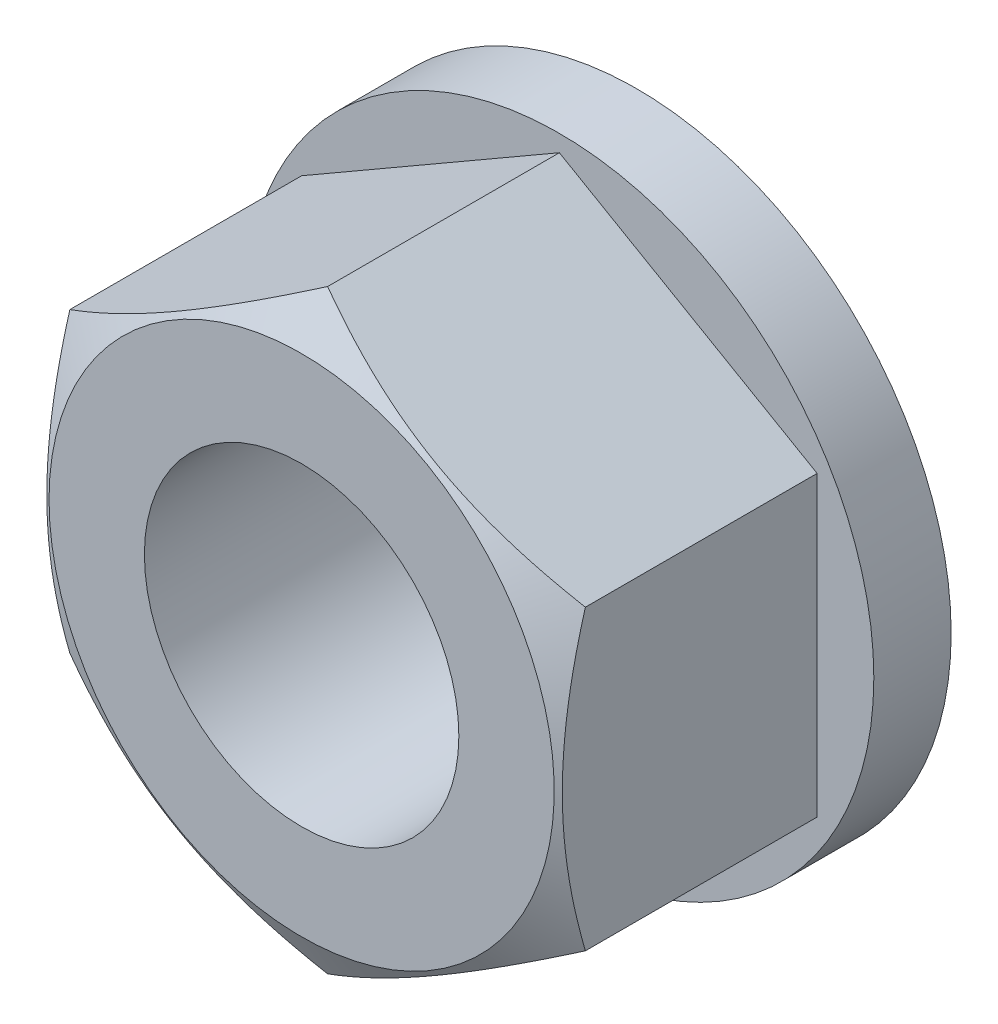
ISO-10303-21;
HEADER;
FILE_DESCRIPTION(('STEP AP214'),'2;1');
FILE_NAME('part.step','',(''),(''),'','','');
FILE_SCHEMA(('AUTOMOTIVE_DESIGN { 1 0 10303 214 1 1 1 1 }'));
ENDSEC;
DATA;
#1=APPLICATION_CONTEXT('core data for automotive mechanical design processes');
#2=APPLICATION_PROTOCOL_DEFINITION('international standard','automotive_design',2000,#1);
#3=PRODUCT_CONTEXT('',#1,'mechanical');
#4=PRODUCT('Part','Part','',(#3));
#5=PRODUCT_RELATED_PRODUCT_CATEGORY('part','',(#4));
#6=PRODUCT_DEFINITION_FORMATION('','',#4);
#7=PRODUCT_DEFINITION_CONTEXT('part definition',#1,'design');
#8=PRODUCT_DEFINITION('design','',#6,#7);
#9=PRODUCT_DEFINITION_SHAPE('','',#8);
#10=(LENGTH_UNIT() NAMED_UNIT(*) SI_UNIT(.MILLI.,.METRE.));
#11=(NAMED_UNIT(*) PLANE_ANGLE_UNIT() SI_UNIT($,.RADIAN.));
#12=(NAMED_UNIT(*) SI_UNIT($,.STERADIAN.) SOLID_ANGLE_UNIT());
#13=UNCERTAINTY_MEASURE_WITH_UNIT(LENGTH_MEASURE(1.E-05),#10,'distance_accuracy_value','');
#14=(GEOMETRIC_REPRESENTATION_CONTEXT(3) GLOBAL_UNCERTAINTY_ASSIGNED_CONTEXT((#13)) GLOBAL_UNIT_ASSIGNED_CONTEXT((#10,
#11,#12)) REPRESENTATION_CONTEXT('',''));
#15=CARTESIAN_POINT('',(0.,0.,0.));
#16=DIRECTION('',(0.,0.,1.));
#17=DIRECTION('',(1.,0.,0.));
#18=AXIS2_PLACEMENT_3D('',#15,#16,#17);
#19=CARTESIAN_POINT('',(0.,0.,1.5));
#20=DIRECTION('',(0.,0.,1.));
#21=DIRECTION('',(1.,0.,0.));
#22=AXIS2_PLACEMENT_3D('',#19,#20,#21);
#23=PLANE('',#22);
#24=CARTESIAN_POINT('',(0.,0.,1.5));
#25=DIRECTION('',(0.,0.,1.));
#26=DIRECTION('',(1.,0.,0.));
#27=AXIS2_PLACEMENT_3D('',#24,#25,#26);
#28=CIRCLE('',#27,6.1);
#29=CARTESIAN_POINT('',(6.1,0.,1.5));
#30=VERTEX_POINT('',#29);
#31=EDGE_CURVE('E28',#30,#30,#28,.T.);
#32=ORIENTED_EDGE('',*,*,#31,.T.);
#33=EDGE_LOOP('',(#32));
#34=FACE_BOUND('',#33,.T.);
#35=DIRECTION('',(-0.866025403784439,-0.5,0.));
#36=VECTOR('',#35,1.);
#37=CARTESIAN_POINT('',(0.,5.77350269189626,1.5));
#38=LINE('',#37,#36);
#39=CARTESIAN_POINT('',(0.,5.77350269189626,1.5));
#40=VERTEX_POINT('',#39);
#41=CARTESIAN_POINT('',(-5.,2.88675134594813,1.5));
#42=VERTEX_POINT('',#41);
#43=EDGE_CURVE('E131',#40,#42,#38,.T.);
#44=ORIENTED_EDGE('',*,*,#43,.F.);
#45=DIRECTION('',(-0.866025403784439,0.5,0.));
#46=VECTOR('',#45,1.);
#47=CARTESIAN_POINT('',(5.,2.88675134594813,1.5));
#48=LINE('',#47,#46);
#49=CARTESIAN_POINT('',(5.,2.88675134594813,1.5));
#50=VERTEX_POINT('',#49);
#51=EDGE_CURVE('E129',#50,#40,#48,.T.);
#52=ORIENTED_EDGE('',*,*,#51,.F.);
#53=DIRECTION('',(0.,1.,0.));
#54=VECTOR('',#53,1.);
#55=CARTESIAN_POINT('',(5.,-2.88675134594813,1.5));
#56=LINE('',#55,#54);
#57=CARTESIAN_POINT('',(5.,-2.88675134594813,1.5));
#58=VERTEX_POINT('',#57);
#59=EDGE_CURVE('E86',#58,#50,#56,.T.);
#60=ORIENTED_EDGE('',*,*,#59,.F.);
#61=DIRECTION('',(0.866025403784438,0.5,0.));
#62=VECTOR('',#61,1.);
#63=CARTESIAN_POINT('',(0.,-5.77350269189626,1.5));
#64=LINE('',#63,#62);
#65=CARTESIAN_POINT('',(0.,-5.77350269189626,1.5));
#66=VERTEX_POINT('',#65);
#67=EDGE_CURVE('E91',#66,#58,#64,.T.);
#68=ORIENTED_EDGE('',*,*,#67,.F.);
#69=DIRECTION('',(0.866025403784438,-0.5,0.));
#70=VECTOR('',#69,1.);
#71=CARTESIAN_POINT('',(-5.,-2.88675134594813,1.5));
#72=LINE('',#71,#70);
#73=CARTESIAN_POINT('',(-5.,-2.88675134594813,1.5));
#74=VERTEX_POINT('',#73);
#75=EDGE_CURVE('E145',#74,#66,#72,.T.);
#76=ORIENTED_EDGE('',*,*,#75,.F.);
#77=DIRECTION('',(0.,-1.,0.));
#78=VECTOR('',#77,1.);
#79=CARTESIAN_POINT('',(-5.,2.88675134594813,1.5));
#80=LINE('',#79,#78);
#81=EDGE_CURVE('E142',#42,#74,#80,.T.);
#82=ORIENTED_EDGE('',*,*,#81,.F.);
#83=EDGE_LOOP('',(#44,#52,#60,#68,#76,#82));
#84=FACE_BOUND('',#83,.T.);
#85=ADVANCED_FACE('F14',(#34,#84),#23,.T.);
#86=CARTESIAN_POINT('',(0.,0.,0.));
#87=DIRECTION('',(0.,0.,1.));
#88=DIRECTION('',(1.,0.,0.));
#89=AXIS2_PLACEMENT_3D('',#86,#87,#88);
#90=PLANE('',#89);
#91=CARTESIAN_POINT('',(0.,0.,0.));
#92=DIRECTION('',(0.,0.,1.));
#93=DIRECTION('',(1.,0.,0.));
#94=AXIS2_PLACEMENT_3D('',#91,#92,#93);
#95=CIRCLE('',#94,6.1);
#96=CARTESIAN_POINT('',(6.1,0.,0.));
#97=VERTEX_POINT('',#96);
#98=EDGE_CURVE('E104',#97,#97,#95,.T.);
#99=ORIENTED_EDGE('',*,*,#98,.F.);
#100=EDGE_LOOP('',(#99));
#101=FACE_BOUND('',#100,.T.);
#102=CARTESIAN_POINT('',(0.,0.,0.));
#103=DIRECTION('',(0.,0.,1.));
#104=DIRECTION('',(1.,0.,0.));
#105=AXIS2_PLACEMENT_3D('',#102,#103,#104);
#106=CIRCLE('',#105,3.05);
#107=CARTESIAN_POINT('',(3.05,0.,0.));
#108=VERTEX_POINT('',#107);
#109=EDGE_CURVE('E101',#108,#108,#106,.T.);
#110=ORIENTED_EDGE('',*,*,#109,.T.);
#111=EDGE_LOOP('',(#110));
#112=FACE_BOUND('',#111,.T.);
#113=ADVANCED_FACE('F114',(#101,#112),#90,.F.);
#114=CARTESIAN_POINT('',(0.,0.,1.5));
#115=DIRECTION('',(0.,0.,-1.));
#116=DIRECTION('',(-1.,0.,0.));
#117=AXIS2_PLACEMENT_3D('',#114,#115,#116);
#118=CYLINDRICAL_SURFACE('',#117,6.1);
#119=ORIENTED_EDGE('',*,*,#31,.F.);
#120=EDGE_LOOP('',(#119));
#121=FACE_BOUND('',#120,.T.);
#122=ORIENTED_EDGE('',*,*,#98,.T.);
#123=EDGE_LOOP('',(#122));
#124=FACE_BOUND('',#123,.T.);
#125=ADVANCED_FACE('F16',(#121,#124),#118,.T.);
#126=CARTESIAN_POINT('',(0.,0.,1.5));
#127=DIRECTION('',(0.,0.,-1.));
#128=DIRECTION('',(-1.,0.,0.));
#129=AXIS2_PLACEMENT_3D('',#126,#127,#128);
#130=CYLINDRICAL_SURFACE('',#129,3.05);
#131=ORIENTED_EDGE('',*,*,#109,.F.);
#132=EDGE_LOOP('',(#131));
#133=FACE_BOUND('',#132,.T.);
#134=CARTESIAN_POINT('',(0.,0.,6.5));
#135=DIRECTION('',(0.,0.,1.));
#136=DIRECTION('',(1.,0.,0.));
#137=AXIS2_PLACEMENT_3D('',#134,#135,#136);
#138=CIRCLE('',#137,3.05);
#139=CARTESIAN_POINT('',(3.05,0.,6.5));
#140=VERTEX_POINT('',#139);
#141=EDGE_CURVE('E81',#140,#140,#138,.T.);
#142=ORIENTED_EDGE('',*,*,#141,.T.);
#143=EDGE_LOOP('',(#142));
#144=FACE_BOUND('',#143,.T.);
#145=ADVANCED_FACE('F113',(#133,#144),#130,.F.);
#146=CARTESIAN_POINT('',(0.,5.77350269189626,6.5));
#147=DIRECTION('',(0.,0.,1.));
#148=DIRECTION('',(1.,0.,0.));
#149=AXIS2_PLACEMENT_3D('',#146,#147,#148);
#150=PLANE('',#149);
#151=CARTESIAN_POINT('',(0.,0.,6.5));
#152=DIRECTION('',(0.,0.,-1.));
#153=DIRECTION('',(-1.,0.,0.));
#154=AXIS2_PLACEMENT_3D('',#151,#152,#153);
#155=CIRCLE('',#154,4.9);
#156=CARTESIAN_POINT('',(-4.9,0.,6.5));
#157=VERTEX_POINT('',#156);
#158=EDGE_CURVE('E226',#157,#157,#155,.T.);
#159=ORIENTED_EDGE('',*,*,#158,.F.);
#160=EDGE_LOOP('',(#159));
#161=FACE_BOUND('',#160,.T.);
#162=ORIENTED_EDGE('',*,*,#141,.F.);
#163=EDGE_LOOP('',(#162));
#164=FACE_BOUND('',#163,.T.);
#165=ADVANCED_FACE('F124',(#161,#164),#150,.T.);
#166=CARTESIAN_POINT('',(5.,2.88675134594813,6.5));
#167=DIRECTION('',(-0.5,-0.866025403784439,0.));
#168=DIRECTION('',(0.866025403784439,-0.5,0.));
#169=AXIS2_PLACEMENT_3D('',#166,#167,#168);
#170=PLANE('',#169);
#171=DIRECTION('',(0.,0.,-1.));
#172=VECTOR('',#171,1.);
#173=CARTESIAN_POINT('',(0.,5.77350269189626,6.5));
#174=LINE('',#173,#172);
#175=CARTESIAN_POINT('',(0.,5.77350269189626,5.99568298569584));
#176=VERTEX_POINT('',#175);
#177=EDGE_CURVE('E80',#176,#40,#174,.T.);
#178=ORIENTED_EDGE('',*,*,#177,.F.);
#179=CARTESIAN_POINT('',(-0.000199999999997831,5.7736181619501,5.99561631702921));
#180=CARTESIAN_POINT('',(0.219534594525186,5.64675433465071,6.0688784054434));
#181=CARTESIAN_POINT('',(0.441148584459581,5.5188054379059,6.13551365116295));
#182=CARTESIAN_POINT('',(0.888213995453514,5.26069210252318,6.25182598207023));
#183=CARTESIAN_POINT('',(1.11367335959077,5.13052307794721,6.30146192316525));
#184=CARTESIAN_POINT('',(1.56183230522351,4.87177839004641,6.37871394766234));
#185=CARTESIAN_POINT('',(1.78446209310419,4.74324302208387,6.40684459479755));
#186=CARTESIAN_POINT('',(2.11918990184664,4.54998783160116,6.43207005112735));
#187=CARTESIAN_POINT('',(2.23084219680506,4.48552534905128,6.43765151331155));
#188=CARTESIAN_POINT('',(2.4542499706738,4.35654081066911,6.44306275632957));
#189=CARTESIAN_POINT('',(2.56600544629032,4.29201875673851,6.44289271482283));
#190=CARTESIAN_POINT('',(2.87218423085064,4.11524635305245,6.43451134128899));
#191=CARTESIAN_POINT('',(3.06650608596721,4.00305457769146,6.42043520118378));
#192=CARTESIAN_POINT('',(3.4538601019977,3.77941563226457,6.37579971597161));
#193=CARTESIAN_POINT('',(3.64689090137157,3.66796924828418,6.34522511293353));
#194=CARTESIAN_POINT('',(4.03502534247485,3.44387972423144,6.26879647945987));
#195=CARTESIAN_POINT('',(4.23007999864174,3.3312648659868,6.22261859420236));
#196=CARTESIAN_POINT('',(4.61728034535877,3.10771464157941,6.1178131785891));
#197=CARTESIAN_POINT('',(4.80943099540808,2.99677641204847,6.05921026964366));
#198=CARTESIAN_POINT('',(5.0002,2.88663587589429,5.99561631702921));
#199=B_SPLINE_CURVE_WITH_KNOTS('',3,(#179,#180,#181,#182,#183,#184,#185,#186,#187,#188,#189,
#190,#191,#192,#193,#194,#195,#196,#197,#198),.UNSPECIFIED.,.F.,.F.,(4,2,2,2,2,2,2,2,2,4),(0.,
0.792555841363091,1.58701660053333,2.3618153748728,2.74884076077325,3.13585419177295,
3.80962362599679,4.48401723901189,5.17336882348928,5.86136694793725),.UNSPECIFIED.);
#200=CARTESIAN_POINT('',(5.,2.88675134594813,5.99568298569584));
#201=VERTEX_POINT('',#200);
#202=EDGE_CURVE('E72',#176,#201,#199,.T.);
#203=ORIENTED_EDGE('',*,*,#202,.T.);
#204=DIRECTION('',(0.,0.,-1.));
#205=VECTOR('',#204,1.);
#206=CARTESIAN_POINT('',(5.,2.88675134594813,6.5));
#207=LINE('',#206,#205);
#208=EDGE_CURVE('E79',#201,#50,#207,.T.);
#209=ORIENTED_EDGE('',*,*,#208,.T.);
#210=ORIENTED_EDGE('',*,*,#51,.T.);
#211=EDGE_LOOP('',(#178,#203,#209,#210));
#212=FACE_BOUND('',#211,.T.);
#213=ADVANCED_FACE('F77',(#212),#170,.F.);
#214=CARTESIAN_POINT('',(0.,5.77350269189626,6.5));
#215=DIRECTION('',(0.5,-0.866025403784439,0.));
#216=DIRECTION('',(0.866025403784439,0.5,0.));
#217=AXIS2_PLACEMENT_3D('',#214,#215,#216);
#218=PLANE('',#217);
#219=DIRECTION('',(0.,0.,-1.));
#220=VECTOR('',#219,1.);
#221=CARTESIAN_POINT('',(-5.,2.88675134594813,6.5));
#222=LINE('',#221,#220);
#223=CARTESIAN_POINT('',(-5.,2.88675134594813,5.99568298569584));
#224=VERTEX_POINT('',#223);
#225=EDGE_CURVE('E98',#224,#42,#222,.T.);
#226=ORIENTED_EDGE('',*,*,#225,.F.);
#227=CARTESIAN_POINT('',(-5.0002,2.88663587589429,5.99561631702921));
#228=CARTESIAN_POINT('',(-4.78046540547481,3.01349970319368,6.0688784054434));
#229=CARTESIAN_POINT('',(-4.55885141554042,3.14144859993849,6.13551365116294));
#230=CARTESIAN_POINT('',(-4.11178600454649,3.39956193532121,6.25182598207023));
#231=CARTESIAN_POINT('',(-3.88632664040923,3.52973095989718,6.30146192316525));
#232=CARTESIAN_POINT('',(-3.43816769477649,3.78847564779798,6.37871394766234));
#233=CARTESIAN_POINT('',(-3.21553790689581,3.91701101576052,6.40684459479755));
#234=CARTESIAN_POINT('',(-2.88081009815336,4.11026620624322,6.43207005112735));
#235=CARTESIAN_POINT('',(-2.76915780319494,4.17472868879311,6.43765151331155));
#236=CARTESIAN_POINT('',(-2.54575002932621,4.30371322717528,6.44306275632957));
#237=CARTESIAN_POINT('',(-2.43399455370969,4.36823528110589,6.44289271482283));
#238=CARTESIAN_POINT('',(-2.12781576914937,4.54500768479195,6.43451134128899));
#239=CARTESIAN_POINT('',(-1.93349391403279,4.65719946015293,6.42043520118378));
#240=CARTESIAN_POINT('',(-1.5461398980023,4.88083840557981,6.37579971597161));
#241=CARTESIAN_POINT('',(-1.35310909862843,4.9922847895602,6.34522511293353));
#242=CARTESIAN_POINT('',(-0.964974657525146,5.21637431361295,6.26879647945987));
#243=CARTESIAN_POINT('',(-0.769920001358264,5.32898917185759,6.22261859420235));
#244=CARTESIAN_POINT('',(-0.382719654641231,5.55253939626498,6.1178131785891));
#245=CARTESIAN_POINT('',(-0.190569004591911,5.66347762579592,6.05921026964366));
#246=CARTESIAN_POINT('',(0.000200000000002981,5.7736181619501,5.99561631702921));
#247=B_SPLINE_CURVE_WITH_KNOTS('',3,(#227,#228,#229,#230,#231,#232,#233,#234,#235,#236,#237,
#238,#239,#240,#241,#242,#243,#244,#245,#246),.UNSPECIFIED.,.F.,.F.,(4,2,2,2,2,2,2,2,2,4),(0.,
0.79255584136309,1.58701660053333,2.3618153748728,2.74884076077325,3.13585419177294,
3.80962362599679,4.48401723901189,5.17336882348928,5.86136694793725),.UNSPECIFIED.);
#248=EDGE_CURVE('E82',#224,#176,#247,.T.);
#249=ORIENTED_EDGE('',*,*,#248,.T.);
#250=ORIENTED_EDGE('',*,*,#177,.T.);
#251=ORIENTED_EDGE('',*,*,#43,.T.);
#252=EDGE_LOOP('',(#226,#249,#250,#251));
#253=FACE_BOUND('',#252,.T.);
#254=ADVANCED_FACE('F156',(#253),#218,.F.);
#255=CARTESIAN_POINT('',(-5.,2.88675134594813,6.5));
#256=DIRECTION('',(1.,0.,0.));
#257=DIRECTION('',(0.,0.,-1.));
#258=AXIS2_PLACEMENT_3D('',#255,#256,#257);
#259=PLANE('',#258);
#260=DIRECTION('',(0.,0.,-1.));
#261=VECTOR('',#260,1.);
#262=CARTESIAN_POINT('',(-5.,-2.88675134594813,6.5));
#263=LINE('',#262,#261);
#264=CARTESIAN_POINT('',(-5.,-2.88675134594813,5.99568298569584));
#265=VERTEX_POINT('',#264);
#266=EDGE_CURVE('E96',#265,#74,#263,.T.);
#267=ORIENTED_EDGE('',*,*,#266,.F.);
#268=CARTESIAN_POINT('',(-5.,-7.74385665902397,4.00713332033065));
#269=CARTESIAN_POINT('',(-5.,-7.52556166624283,4.11298446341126));
#270=CARTESIAN_POINT('',(-5.,-7.30676445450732,4.21781768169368));
#271=CARTESIAN_POINT('',(-5.,-6.86789848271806,4.42487556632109));
#272=CARTESIAN_POINT('',(-5.,-6.64782952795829,4.52709981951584));
#273=CARTESIAN_POINT('',(-5.,-6.20501413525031,4.72888357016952));
#274=CARTESIAN_POINT('',(-5.,-5.98225963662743,4.82842543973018));
#275=CARTESIAN_POINT('',(-5.,-5.53497532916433,5.02342184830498));
#276=CARTESIAN_POINT('',(-5.,-5.31044560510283,5.1188765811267));
#277=CARTESIAN_POINT('',(-5.,-4.85204276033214,5.30758789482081));
#278=CARTESIAN_POINT('',(-5.,-4.6181002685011,5.40067688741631));
#279=CARTESIAN_POINT('',(-5.,-4.1474744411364,5.5797845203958));
#280=CARTESIAN_POINT('',(-5.,-3.91079080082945,5.66580236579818));
#281=CARTESIAN_POINT('',(-5.,-3.43475256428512,5.82850202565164));
#282=CARTESIAN_POINT('',(-5.,-3.19540452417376,5.90520282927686));
#283=CARTESIAN_POINT('',(-5.,-2.71327509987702,6.04680031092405));
#284=CARTESIAN_POINT('',(-5.,-2.4704948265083,6.11170071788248));
#285=CARTESIAN_POINT('',(-5.,-1.98271095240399,6.22623066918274));
#286=CARTESIAN_POINT('',(-5.,-1.73772709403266,6.27594274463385));
#287=CARTESIAN_POINT('',(-5.,-1.24472344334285,6.35727976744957));
#288=CARTESIAN_POINT('',(-5.,-0.99670393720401,6.38890640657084));
#289=CARTESIAN_POINT('',(-5.,-0.502103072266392,6.43113541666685));
#290=CARTESIAN_POINT('',(-5.,-0.255545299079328,6.44200722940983));
#291=CARTESIAN_POINT('',(-5.,0.237611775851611,6.44251343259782));
#292=CARTESIAN_POINT('',(-5.,0.484211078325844,6.43214739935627));
#293=CARTESIAN_POINT('',(-5.,0.90317016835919,6.39722600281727));
#294=CARTESIAN_POINT('',(-5.,1.0759793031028,6.37775603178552));
#295=CARTESIAN_POINT('',(-5.,1.42031821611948,6.32960433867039));
#296=CARTESIAN_POINT('',(-5.,1.59184781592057,6.30092135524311));
#297=CARTESIAN_POINT('',(-5.,2.10429724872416,6.20256195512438));
#298=CARTESIAN_POINT('',(-5.,2.44288326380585,6.12059343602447));
#299=CARTESIAN_POINT('',(-5.,2.94914307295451,5.97864180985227));
#300=CARTESIAN_POINT('',(-5.,3.1194458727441,5.92750243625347));
#301=CARTESIAN_POINT('',(-5.,3.45839674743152,5.8199582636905));
#302=CARTESIAN_POINT('',(-5.,3.62704481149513,5.76355343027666));
#303=CARTESIAN_POINT('',(-5.,3.96274051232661,5.64637965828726));
#304=CARTESIAN_POINT('',(-5.,4.12978866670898,5.58561218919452));
#305=CARTESIAN_POINT('',(-5.,4.46250408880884,5.46042345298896));
#306=CARTESIAN_POINT('',(-5.,4.62817137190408,5.39600222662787));
#307=CARTESIAN_POINT('',(-5.,5.01585230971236,5.24111094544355));
#308=CARTESIAN_POINT('',(-5.,5.23736606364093,5.14939206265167));
#309=CARTESIAN_POINT('',(-5.,5.67853516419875,4.96157675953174));
#310=CARTESIAN_POINT('',(-5.,5.89819040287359,4.86548008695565));
#311=CARTESIAN_POINT('',(-5.,6.33598069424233,4.66977990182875));
#312=CARTESIAN_POINT('',(-5.,6.55411544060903,4.5701757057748));
#313=CARTESIAN_POINT('',(-5.,6.98907842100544,4.36815014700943));
#314=CARTESIAN_POINT('',(-5.,7.20590662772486,4.26572872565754));
#315=CARTESIAN_POINT('',(-5.,7.85517278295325,3.95485317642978));
#316=CARTESIAN_POINT('',(-5.,8.28597179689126,3.74297831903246));
#317=CARTESIAN_POINT('',(-5.,9.14446954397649,3.3130389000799));
#318=CARTESIAN_POINT('',(-5.,9.57216816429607,3.09497411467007));
#319=CARTESIAN_POINT('',(-5.,10.1943598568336,2.77367769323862));
#320=CARTESIAN_POINT('',(-5.,10.3897552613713,2.67218832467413));
#321=CARTESIAN_POINT('',(-5.,10.7801206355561,2.46840316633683));
#322=CARTESIAN_POINT('',(-5.,10.9750906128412,2.36610739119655));
#323=CARTESIAN_POINT('',(-5.,11.5594649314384,2.05816473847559));
#324=CARTESIAN_POINT('',(-5.,11.9483175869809,1.85147085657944));
#325=CARTESIAN_POINT('',(-5.,12.7239360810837,1.43645983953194));
#326=CARTESIAN_POINT('',(-5.,13.1107046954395,1.2281478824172));
#327=CARTESIAN_POINT('',(-5.,13.8833085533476,0.809849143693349));
#328=CARTESIAN_POINT('',(-5.,14.2691438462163,0.599862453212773));
#329=CARTESIAN_POINT('',(-5.,14.6546345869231,0.389249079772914));
#330=B_SPLINE_CURVE_WITH_KNOTS('',3,(#268,#269,#270,#271,#272,#273,#274,#275,#276,#277,#278,
#279,#280,#281,#282,#283,#284,#285,#286,#287,#288,#289,#290,#291,#292,#293,#294,#295,#296,#297,
#298,#299,#300,#301,#302,#303,#304,#305,#306,#307,#308,#309,#310,#311,#312,#313,#314,#315,#316,
#317,#318,#319,#320,#321,#322,#323,#324,#325,#326,#327,#328,#329),.UNSPECIFIED.,.F.,.F.,(4,2,2,
2,2,2,2,2,2,2,2,2,2,2,2,2,2,2,2,2,2,2,2,2,2,2,2,2,2,2,4),(0.,0.727823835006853,1.45576222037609,
2.18768108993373,2.91956521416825,3.67482570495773,4.43017099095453,5.18395000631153,
5.93749041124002,6.68686021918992,7.43615991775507,8.17566414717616,8.91518312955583,
9.43663740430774,9.9581631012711,11.0017977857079,11.5351990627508,12.0686038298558,
12.6018297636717,13.1350497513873,13.8542406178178,14.5734729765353,15.2928462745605,
16.0122345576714,17.4523957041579,18.8926089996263,19.5531489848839,20.2136770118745,
21.5347873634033,22.8526808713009,24.1705031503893),.UNSPECIFIED.);
#331=EDGE_CURVE('E158',#265,#224,#330,.T.);
#332=ORIENTED_EDGE('',*,*,#331,.T.);
#333=ORIENTED_EDGE('',*,*,#225,.T.);
#334=ORIENTED_EDGE('',*,*,#81,.T.);
#335=EDGE_LOOP('',(#267,#332,#333,#334));
#336=FACE_BOUND('',#335,.T.);
#337=ADVANCED_FACE('F198',(#336),#259,.F.);
#338=CARTESIAN_POINT('',(-5.,-2.88675134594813,6.5));
#339=DIRECTION('',(0.5,0.866025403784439,0.));
#340=DIRECTION('',(-0.866025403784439,0.5,0.));
#341=AXIS2_PLACEMENT_3D('',#338,#339,#340);
#342=PLANE('',#341);
#343=DIRECTION('',(0.,0.,-1.));
#344=VECTOR('',#343,1.);
#345=CARTESIAN_POINT('',(0.,-5.77350269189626,6.5));
#346=LINE('',#345,#344);
#347=CARTESIAN_POINT('',(0.,-5.77350269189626,5.99568298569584));
#348=VERTEX_POINT('',#347);
#349=EDGE_CURVE('E89',#348,#66,#346,.T.);
#350=ORIENTED_EDGE('',*,*,#349,.F.);
#351=CARTESIAN_POINT('',(0.000199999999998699,-5.7736181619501,5.99561631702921));
#352=CARTESIAN_POINT('',(-0.219534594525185,-5.64675433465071,6.0688784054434));
#353=CARTESIAN_POINT('',(-0.44114858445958,-5.5188054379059,6.13551365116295));
#354=CARTESIAN_POINT('',(-0.888213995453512,-5.26069210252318,6.25182598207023));
#355=CARTESIAN_POINT('',(-1.11367335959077,-5.13052307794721,6.30146192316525));
#356=CARTESIAN_POINT('',(-1.56183230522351,-4.87177839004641,6.37871394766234));
#357=CARTESIAN_POINT('',(-1.78446209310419,-4.74324302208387,6.40684459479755));
#358=CARTESIAN_POINT('',(-2.11918990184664,-4.54998783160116,6.43207005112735));
#359=CARTESIAN_POINT('',(-2.23084219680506,-4.48552534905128,6.43765151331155));
#360=CARTESIAN_POINT('',(-2.4542499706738,-4.35654081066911,6.44306275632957));
#361=CARTESIAN_POINT('',(-2.56600544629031,-4.2920187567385,6.44289271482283));
#362=CARTESIAN_POINT('',(-2.87218423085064,-4.11524635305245,6.43451134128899));
#363=CARTESIAN_POINT('',(-3.06650608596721,-4.00305457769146,6.42043520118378));
#364=CARTESIAN_POINT('',(-3.45386010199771,-3.77941563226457,6.37579971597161));
#365=CARTESIAN_POINT('',(-3.64689090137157,-3.66796924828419,6.34522511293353));
#366=CARTESIAN_POINT('',(-4.03502534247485,-3.44387972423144,6.26879647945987));
#367=CARTESIAN_POINT('',(-4.23007999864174,-3.3312648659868,6.22261859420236));
#368=CARTESIAN_POINT('',(-4.61728034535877,-3.10771464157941,6.1178131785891));
#369=CARTESIAN_POINT('',(-4.80943099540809,-2.99677641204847,6.05921026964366));
#370=CARTESIAN_POINT('',(-5.0002,-2.88663587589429,5.99561631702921));
#371=B_SPLINE_CURVE_WITH_KNOTS('',3,(#351,#352,#353,#354,#355,#356,#357,#358,#359,#360,#361,
#362,#363,#364,#365,#366,#367,#368,#369,#370),.UNSPECIFIED.,.F.,.F.,(4,2,2,2,2,2,2,2,2,4),(0.,
0.79255584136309,1.58701660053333,2.3618153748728,2.74884076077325,3.13585419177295,
3.80962362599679,4.48401723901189,5.17336882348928,5.86136694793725),.UNSPECIFIED.);
#372=EDGE_CURVE('E159',#348,#265,#371,.T.);
#373=ORIENTED_EDGE('',*,*,#372,.T.);
#374=ORIENTED_EDGE('',*,*,#266,.T.);
#375=ORIENTED_EDGE('',*,*,#75,.T.);
#376=EDGE_LOOP('',(#350,#373,#374,#375));
#377=FACE_BOUND('',#376,.T.);
#378=ADVANCED_FACE('F195',(#377),#342,.F.);
#379=CARTESIAN_POINT('',(0.,-5.77350269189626,6.5));
#380=DIRECTION('',(-0.5,0.866025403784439,0.));
#381=DIRECTION('',(-0.866025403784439,-0.5,0.));
#382=AXIS2_PLACEMENT_3D('',#379,#380,#381);
#383=PLANE('',#382);
#384=DIRECTION('',(0.,0.,-1.));
#385=VECTOR('',#384,1.);
#386=CARTESIAN_POINT('',(5.,-2.88675134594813,6.5));
#387=LINE('',#386,#385);
#388=CARTESIAN_POINT('',(5.,-2.88675134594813,5.99568298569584));
#389=VERTEX_POINT('',#388);
#390=EDGE_CURVE('E41',#389,#58,#387,.T.);
#391=ORIENTED_EDGE('',*,*,#390,.F.);
#392=CARTESIAN_POINT('',(5.0002,-2.88663587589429,5.99561631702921));
#393=CARTESIAN_POINT('',(4.78046540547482,-3.01349970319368,6.0688784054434));
#394=CARTESIAN_POINT('',(4.55885141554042,-3.14144859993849,6.13551365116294));
#395=CARTESIAN_POINT('',(4.11178600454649,-3.39956193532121,6.25182598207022));
#396=CARTESIAN_POINT('',(3.88632664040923,-3.52973095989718,6.30146192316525));
#397=CARTESIAN_POINT('',(3.43816769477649,-3.78847564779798,6.37871394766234));
#398=CARTESIAN_POINT('',(3.21553790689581,-3.91701101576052,6.40684459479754));
#399=CARTESIAN_POINT('',(2.88081009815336,-4.11026620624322,6.43207005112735));
#400=CARTESIAN_POINT('',(2.76915780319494,-4.17472868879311,6.43765151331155));
#401=CARTESIAN_POINT('',(2.54575002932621,-4.30371322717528,6.44306275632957));
#402=CARTESIAN_POINT('',(2.43399455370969,-4.36823528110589,6.44289271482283));
#403=CARTESIAN_POINT('',(2.12781576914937,-4.54500768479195,6.43451134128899));
#404=CARTESIAN_POINT('',(1.93349391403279,-4.65719946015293,6.42043520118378));
#405=CARTESIAN_POINT('',(1.5461398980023,-4.88083840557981,6.37579971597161));
#406=CARTESIAN_POINT('',(1.35310909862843,-4.9922847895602,6.34522511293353));
#407=CARTESIAN_POINT('',(0.964974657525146,-5.21637431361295,6.26879647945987));
#408=CARTESIAN_POINT('',(0.769920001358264,-5.32898917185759,6.22261859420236));
#409=CARTESIAN_POINT('',(0.382719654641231,-5.55253939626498,6.1178131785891));
#410=CARTESIAN_POINT('',(0.190569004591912,-5.66347762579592,6.05921026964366));
#411=CARTESIAN_POINT('',(-0.000200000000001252,-5.7736181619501,5.99561631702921));
#412=B_SPLINE_CURVE_WITH_KNOTS('',3,(#392,#393,#394,#395,#396,#397,#398,#399,#400,#401,#402,
#403,#404,#405,#406,#407,#408,#409,#410,#411),.UNSPECIFIED.,.F.,.F.,(4,2,2,2,2,2,2,2,2,4),(0.,
0.792555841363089,1.58701660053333,2.3618153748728,2.74884076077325,3.13585419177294,
3.80962362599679,4.48401723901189,5.17336882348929,5.86136694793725),.UNSPECIFIED.);
#413=EDGE_CURVE('E35',#389,#348,#412,.T.);
#414=ORIENTED_EDGE('',*,*,#413,.T.);
#415=ORIENTED_EDGE('',*,*,#349,.T.);
#416=ORIENTED_EDGE('',*,*,#67,.T.);
#417=EDGE_LOOP('',(#391,#414,#415,#416));
#418=FACE_BOUND('',#417,.T.);
#419=ADVANCED_FACE('F149',(#418),#383,.F.);
#420=CARTESIAN_POINT('',(5.,-2.88675134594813,6.5));
#421=DIRECTION('',(-1.,0.,0.));
#422=DIRECTION('',(0.,0.,1.));
#423=AXIS2_PLACEMENT_3D('',#420,#421,#422);
#424=PLANE('',#423);
#425=ORIENTED_EDGE('',*,*,#208,.F.);
#426=CARTESIAN_POINT('',(5.,-7.74385665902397,4.00713332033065));
#427=CARTESIAN_POINT('',(5.,-7.52556166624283,4.11298446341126));
#428=CARTESIAN_POINT('',(5.,-7.30676445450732,4.21781768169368));
#429=CARTESIAN_POINT('',(5.,-6.86789848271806,4.42487556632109));
#430=CARTESIAN_POINT('',(5.,-6.64782952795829,4.52709981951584));
#431=CARTESIAN_POINT('',(5.,-6.20501413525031,4.72888357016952));
#432=CARTESIAN_POINT('',(5.,-5.98225963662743,4.82842543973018));
#433=CARTESIAN_POINT('',(5.,-5.53497532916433,5.02342184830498));
#434=CARTESIAN_POINT('',(5.,-5.31044560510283,5.1188765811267));
#435=CARTESIAN_POINT('',(5.,-4.85204276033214,5.30758789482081));
#436=CARTESIAN_POINT('',(5.,-4.6181002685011,5.40067688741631));
#437=CARTESIAN_POINT('',(5.,-4.1474744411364,5.5797845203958));
#438=CARTESIAN_POINT('',(5.,-3.91079080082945,5.66580236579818));
#439=CARTESIAN_POINT('',(5.,-3.43475256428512,5.82850202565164));
#440=CARTESIAN_POINT('',(5.,-3.19540452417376,5.90520282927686));
#441=CARTESIAN_POINT('',(5.,-2.71327509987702,6.04680031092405));
#442=CARTESIAN_POINT('',(5.,-2.4704948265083,6.11170071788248));
#443=CARTESIAN_POINT('',(5.,-1.98271095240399,6.22623066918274));
#444=CARTESIAN_POINT('',(5.,-1.73772709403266,6.27594274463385));
#445=CARTESIAN_POINT('',(5.,-1.24472344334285,6.35727976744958));
#446=CARTESIAN_POINT('',(5.,-0.99670393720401,6.38890640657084));
#447=CARTESIAN_POINT('',(5.,-0.502103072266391,6.43113541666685));
#448=CARTESIAN_POINT('',(5.,-0.255545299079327,6.44200722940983));
#449=CARTESIAN_POINT('',(5.,0.237611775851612,6.44251343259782));
#450=CARTESIAN_POINT('',(5.,0.484211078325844,6.43214739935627));
#451=CARTESIAN_POINT('',(5.,0.903170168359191,6.39722600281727));
#452=CARTESIAN_POINT('',(5.,1.0759793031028,6.37775603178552));
#453=CARTESIAN_POINT('',(5.,1.42031821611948,6.32960433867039));
#454=CARTESIAN_POINT('',(5.,1.59184781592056,6.30092135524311));
#455=CARTESIAN_POINT('',(5.,2.10429724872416,6.20256195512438));
#456=CARTESIAN_POINT('',(5.,2.44288326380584,6.12059343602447));
#457=CARTESIAN_POINT('',(5.,2.94914307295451,5.97864180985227));
#458=CARTESIAN_POINT('',(5.,3.1194458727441,5.92750243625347));
#459=CARTESIAN_POINT('',(5.,3.45839674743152,5.8199582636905));
#460=CARTESIAN_POINT('',(5.,3.62704481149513,5.76355343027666));
#461=CARTESIAN_POINT('',(5.,3.96274051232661,5.64637965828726));
#462=CARTESIAN_POINT('',(5.,4.12978866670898,5.58561218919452));
#463=CARTESIAN_POINT('',(5.,4.46250408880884,5.46042345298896));
#464=CARTESIAN_POINT('',(5.,4.62817137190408,5.39600222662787));
#465=CARTESIAN_POINT('',(5.,5.01585230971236,5.24111094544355));
#466=CARTESIAN_POINT('',(5.,5.23736606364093,5.14939206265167));
#467=CARTESIAN_POINT('',(5.,5.67853516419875,4.96157675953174));
#468=CARTESIAN_POINT('',(5.,5.89819040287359,4.86548008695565));
#469=CARTESIAN_POINT('',(5.,6.33598069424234,4.66977990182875));
#470=CARTESIAN_POINT('',(5.,6.55411544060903,4.5701757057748));
#471=CARTESIAN_POINT('',(5.,6.98907842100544,4.36815014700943));
#472=CARTESIAN_POINT('',(5.,7.20590662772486,4.26572872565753));
#473=CARTESIAN_POINT('',(5.,7.85517278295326,3.95485317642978));
#474=CARTESIAN_POINT('',(5.,8.28597179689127,3.74297831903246));
#475=CARTESIAN_POINT('',(5.,9.1444695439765,3.31303890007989));
#476=CARTESIAN_POINT('',(5.,9.57216816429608,3.09497411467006));
#477=CARTESIAN_POINT('',(5.,10.1943598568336,2.77367769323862));
#478=CARTESIAN_POINT('',(5.,10.3897552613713,2.67218832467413));
#479=CARTESIAN_POINT('',(5.,10.7801206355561,2.46840316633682));
#480=CARTESIAN_POINT('',(5.,10.9750906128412,2.36610739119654));
#481=CARTESIAN_POINT('',(5.,11.5594649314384,2.05816473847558));
#482=CARTESIAN_POINT('',(5.,11.9483175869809,1.85147085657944));
#483=CARTESIAN_POINT('',(5.,12.7239360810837,1.43645983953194));
#484=CARTESIAN_POINT('',(5.,13.1107046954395,1.2281478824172));
#485=CARTESIAN_POINT('',(5.,13.8833085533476,0.809849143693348));
#486=CARTESIAN_POINT('',(5.,14.2691438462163,0.599862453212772));
#487=CARTESIAN_POINT('',(5.,14.6546345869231,0.389249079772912));
#488=B_SPLINE_CURVE_WITH_KNOTS('',3,(#426,#427,#428,#429,#430,#431,#432,#433,#434,#435,#436,
#437,#438,#439,#440,#441,#442,#443,#444,#445,#446,#447,#448,#449,#450,#451,#452,#453,#454,#455,
#456,#457,#458,#459,#460,#461,#462,#463,#464,#465,#466,#467,#468,#469,#470,#471,#472,#473,#474,
#475,#476,#477,#478,#479,#480,#481,#482,#483,#484,#485,#486,#487),.UNSPECIFIED.,.F.,.F.,(4,2,2,
2,2,2,2,2,2,2,2,2,2,2,2,2,2,2,2,2,2,2,2,2,2,2,2,2,2,2,4),(0.,0.727823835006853,1.45576222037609,
2.18768108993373,2.91956521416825,3.67482570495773,4.43017099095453,5.18395000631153,
5.93749041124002,6.68686021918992,7.43615991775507,8.17566414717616,8.91518312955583,
9.43663740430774,9.9581631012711,11.0017977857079,11.5351990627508,12.0686038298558,
12.6018297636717,13.1350497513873,13.8542406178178,14.5734729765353,15.2928462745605,
16.0122345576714,17.4523957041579,18.8926089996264,19.553148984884,20.2136770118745,
21.5347873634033,22.8526808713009,24.1705031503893),.UNSPECIFIED.);
#489=EDGE_CURVE('E9',#201,#389,#488,.F.);
#490=ORIENTED_EDGE('',*,*,#489,.T.);
#491=ORIENTED_EDGE('',*,*,#390,.T.);
#492=ORIENTED_EDGE('',*,*,#59,.T.);
#493=EDGE_LOOP('',(#425,#490,#491,#492));
#494=FACE_BOUND('',#493,.T.);
#495=ADVANCED_FACE('F84',(#494),#424,.F.);
#496=CARTESIAN_POINT('',(0.,0.,6.5));
#497=DIRECTION('',(0.,0.,-1.));
#498=DIRECTION('',(-1.,0.,0.));
#499=AXIS2_PLACEMENT_3D('',#496,#497,#498);
#500=CONICAL_SURFACE('',#499,4.9,1.0471975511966);
#501=ORIENTED_EDGE('',*,*,#158,.T.);
#502=EDGE_LOOP('',(#501));
#503=FACE_BOUND('',#502,.T.);
#504=ORIENTED_EDGE('',*,*,#248,.F.);
#505=ORIENTED_EDGE('',*,*,#331,.F.);
#506=ORIENTED_EDGE('',*,*,#372,.F.);
#507=ORIENTED_EDGE('',*,*,#413,.F.);
#508=ORIENTED_EDGE('',*,*,#489,.F.);
#509=ORIENTED_EDGE('',*,*,#202,.F.);
#510=EDGE_LOOP('',(#504,#505,#506,#507,#508,#509));
#511=FACE_BOUND('',#510,.T.);
#512=ADVANCED_FACE('F71',(#503,#511),#500,.T.);
#513=CLOSED_SHELL('',(#85,#113,#125,#145,#165,#213,#254,#337,#378,#419,#495,#512));
#514=MANIFOLD_SOLID_BREP('B1',#513);
#515=ADVANCED_BREP_SHAPE_REPRESENTATION('',(#18,#514),#14);
#516=SHAPE_DEFINITION_REPRESENTATION(#9,#515);
ENDSEC;
END-ISO-10303-21;
